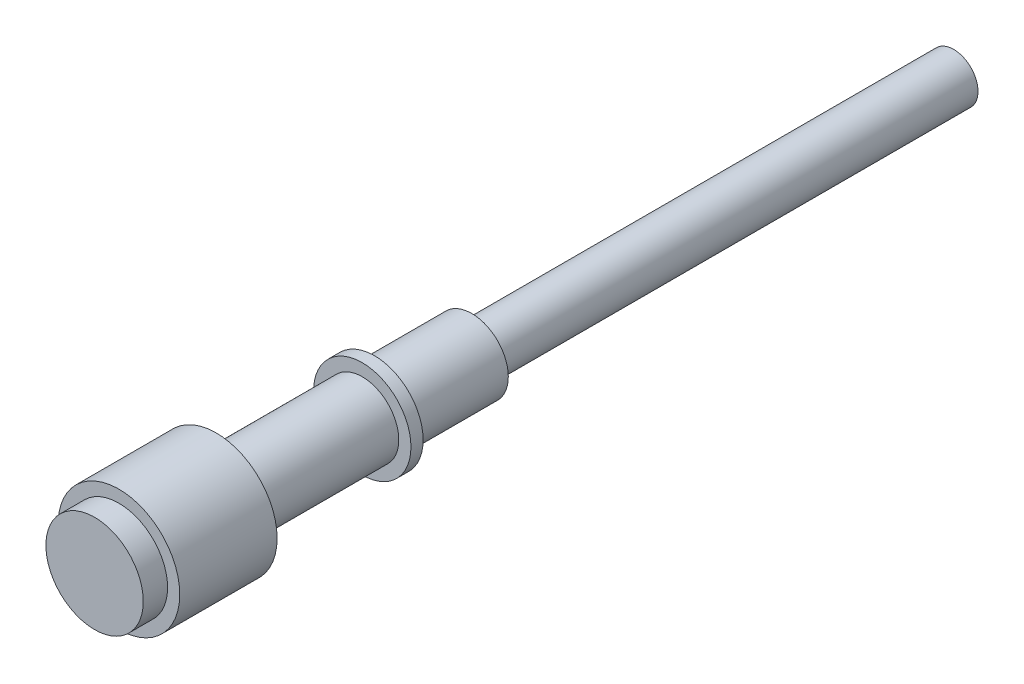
from build123d import *

# Parameters (mm, degrees)
SKETCH2_R           = 6.35
BOSS_EXTRUDE2_DEPTH = 125.73
SKETCH3_R           = 9.525
BOSS_EXTRUDE3_DEPTH = 25.4
SKETCH4_R           = 12.7
BOSS_EXTRUDE4_DEPTH = 3.175
SKETCH5_R           = 9.525
BOSS_EXTRUDE5_DEPTH = 38.1
SKETCH6_R           = 15.875
BOSS_EXTRUDE6_DEPTH = 25.4
SKETCH7_R           = 12.7
BOSS_EXTRUDE7_DEPTH = 6.35


with BuildPart() as part:
    # Sketch2 → Boss-Extrude2 (new body)
    with BuildSketch(Plane.XY):
        Circle(SKETCH2_R)
    extrude(amount=BOSS_EXTRUDE2_DEPTH)

    # Sketch3 → Boss-Extrude3 (add)
    with BuildSketch(Plane.XY.offset(125.73)):
        Circle(SKETCH3_R)
    extrude(amount=BOSS_EXTRUDE3_DEPTH)

    # Sketch4 → Boss-Extrude4 (add)
    with BuildSketch(Plane.XY.offset(151.13)):
        Circle(SKETCH4_R)
    extrude(amount=BOSS_EXTRUDE4_DEPTH)

    # Sketch5 → Boss-Extrude5 (add)
    with BuildSketch(Plane.XY.offset(154.305)):
        Circle(SKETCH5_R)
    extrude(amount=BOSS_EXTRUDE5_DEPTH)

    # Sketch6 → Boss-Extrude6 (add)
    with BuildSketch(Plane.XY.offset(192.405)):
        Circle(SKETCH6_R)
    extrude(amount=BOSS_EXTRUDE6_DEPTH)

    # Sketch7 → Boss-Extrude7 (add)
    with BuildSketch(Plane.XY.offset(217.805)):
        Circle(SKETCH7_R)
    extrude(amount=BOSS_EXTRUDE7_DEPTH)


solid = part.part
